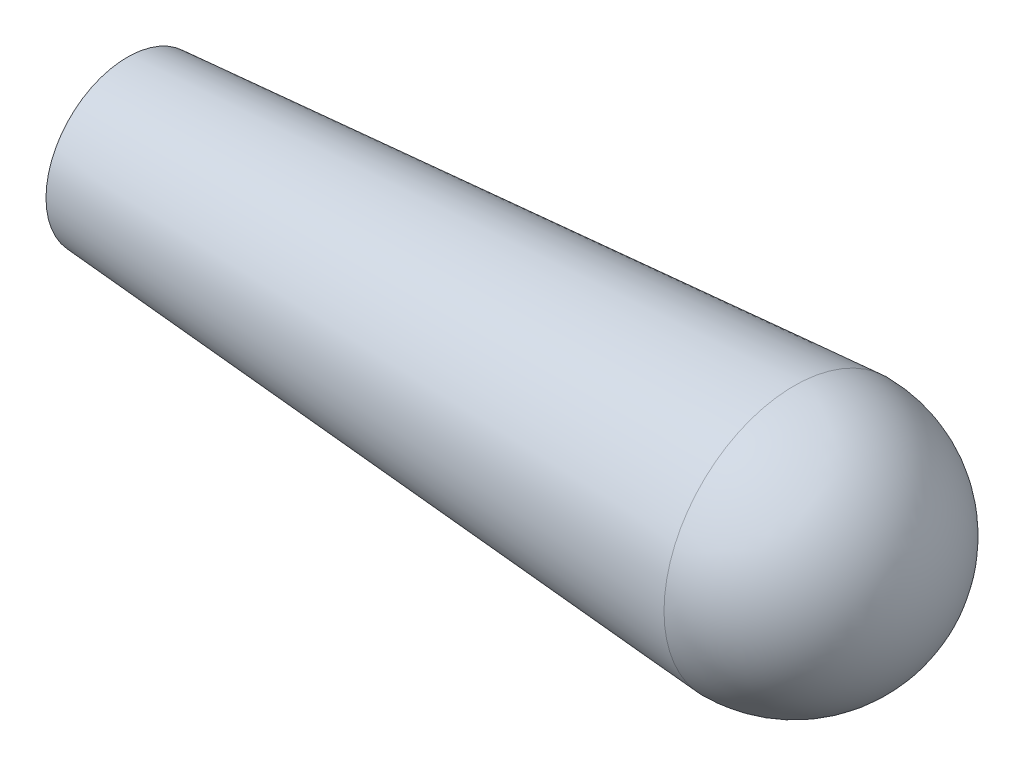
ISO-10303-21;
HEADER;
FILE_DESCRIPTION(('STEP AP214'),'2;1');
FILE_NAME('part.step','',(''),(''),'','','');
FILE_SCHEMA(('AUTOMOTIVE_DESIGN { 1 0 10303 214 1 1 1 1 }'));
ENDSEC;
DATA;
#1=APPLICATION_CONTEXT('core data for automotive mechanical design processes');
#2=APPLICATION_PROTOCOL_DEFINITION('international standard','automotive_design',2000,#1);
#3=PRODUCT_CONTEXT('',#1,'mechanical');
#4=PRODUCT('Part','Part','',(#3));
#5=PRODUCT_RELATED_PRODUCT_CATEGORY('part','',(#4));
#6=PRODUCT_DEFINITION_FORMATION('','',#4);
#7=PRODUCT_DEFINITION_CONTEXT('part definition',#1,'design');
#8=PRODUCT_DEFINITION('design','',#6,#7);
#9=PRODUCT_DEFINITION_SHAPE('','',#8);
#10=(LENGTH_UNIT() NAMED_UNIT(*) SI_UNIT(.MILLI.,.METRE.));
#11=(NAMED_UNIT(*) PLANE_ANGLE_UNIT() SI_UNIT($,.RADIAN.));
#12=(NAMED_UNIT(*) SI_UNIT($,.STERADIAN.) SOLID_ANGLE_UNIT());
#13=UNCERTAINTY_MEASURE_WITH_UNIT(LENGTH_MEASURE(1.E-05),#10,'distance_accuracy_value','');
#14=(GEOMETRIC_REPRESENTATION_CONTEXT(3) GLOBAL_UNCERTAINTY_ASSIGNED_CONTEXT((#13)) GLOBAL_UNIT_ASSIGNED_CONTEXT((#10,
#11,#12)) REPRESENTATION_CONTEXT('',''));
#15=CARTESIAN_POINT('',(0.,0.,0.));
#16=DIRECTION('',(0.,0.,1.));
#17=DIRECTION('',(1.,0.,0.));
#18=AXIS2_PLACEMENT_3D('',#15,#16,#17);
#19=CARTESIAN_POINT('',(-26.1260086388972,0.,0.));
#20=DIRECTION('',(1.,0.,0.));
#21=DIRECTION('',(0.,0.,-1.));
#22=AXIS2_PLACEMENT_3D('',#19,#20,#21);
#23=PLANE('',#22);
#24=DIRECTION('',(0.,0.,-1.));
#25=VECTOR('',#24,1.);
#26=CARTESIAN_POINT('',(-26.1260086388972,3.,-8.));
#27=LINE('',#26,#25);
#28=CARTESIAN_POINT('',(-26.1260086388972,3.,8.));
#29=VERTEX_POINT('',#28);
#30=CARTESIAN_POINT('',(-26.1260086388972,3.,-8.));
#31=VERTEX_POINT('',#30);
#32=EDGE_CURVE('E82',#29,#31,#27,.T.);
#33=ORIENTED_EDGE('',*,*,#32,.F.);
#34=DIRECTION('',(0.,1.,0.));
#35=VECTOR('',#34,1.);
#36=CARTESIAN_POINT('',(-26.1260086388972,-3.,8.));
#37=LINE('',#36,#35);
#38=CARTESIAN_POINT('',(-26.1260086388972,-3.,8.));
#39=VERTEX_POINT('',#38);
#40=EDGE_CURVE('E47',#39,#29,#37,.T.);
#41=ORIENTED_EDGE('',*,*,#40,.F.);
#42=DIRECTION('',(0.,0.,1.));
#43=VECTOR('',#42,1.);
#44=CARTESIAN_POINT('',(-26.1260086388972,-3.,-8.));
#45=LINE('',#44,#43);
#46=CARTESIAN_POINT('',(-26.1260086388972,-3.,-8.));
#47=VERTEX_POINT('',#46);
#48=EDGE_CURVE('E98',#47,#39,#45,.T.);
#49=ORIENTED_EDGE('',*,*,#48,.F.);
#50=DIRECTION('',(0.,-1.,0.));
#51=VECTOR('',#50,1.);
#52=CARTESIAN_POINT('',(-26.1260086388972,-3.,-8.));
#53=LINE('',#52,#51);
#54=EDGE_CURVE('E104',#31,#47,#53,.T.);
#55=ORIENTED_EDGE('',*,*,#54,.F.);
#56=EDGE_LOOP('',(#33,#41,#49,#55));
#57=FACE_BOUND('',#56,.T.);
#58=CARTESIAN_POINT('',(-26.1260086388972,0.,0.));
#59=DIRECTION('',(-1.,0.,0.));
#60=DIRECTION('',(0.,0.,1.));
#61=AXIS2_PLACEMENT_3D('',#58,#59,#60);
#62=CIRCLE('',#61,10.);
#63=CARTESIAN_POINT('',(-26.1260086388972,0.,10.));
#64=VERTEX_POINT('',#63);
#65=EDGE_CURVE('E11',#64,#64,#62,.T.);
#66=ORIENTED_EDGE('',*,*,#65,.T.);
#67=EDGE_LOOP('',(#66));
#68=FACE_BOUND('',#67,.T.);
#69=ADVANCED_FACE('F33',(#57,#68),#23,.F.);
#70=CARTESIAN_POINT('',(55.8739913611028,0.,0.));
#71=DIRECTION('',(1.,0.,0.));
#72=DIRECTION('',(0.,0.,-1.));
#73=AXIS2_PLACEMENT_3D('',#70,#71,#72);
#74=CONICAL_SURFACE('',#73,16.,0.0730405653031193);
#75=ORIENTED_EDGE('',*,*,#65,.F.);
#76=EDGE_LOOP('',(#75));
#77=FACE_BOUND('',#76,.T.);
#78=CARTESIAN_POINT('',(55.8739913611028,0.,0.));
#79=DIRECTION('',(-1.,0.,0.));
#80=DIRECTION('',(0.,0.,1.));
#81=AXIS2_PLACEMENT_3D('',#78,#79,#80);
#82=CIRCLE('',#81,16.);
#83=CARTESIAN_POINT('',(55.8739913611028,0.,16.));
#84=VERTEX_POINT('',#83);
#85=EDGE_CURVE('E40',#84,#84,#82,.T.);
#86=ORIENTED_EDGE('',*,*,#85,.T.);
#87=EDGE_LOOP('',(#86));
#88=FACE_BOUND('',#87,.T.);
#89=ADVANCED_FACE('F112',(#77,#88),#74,.T.);
#90=CARTESIAN_POINT('',(55.8739913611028,0.,0.));
#91=DIRECTION('',(-1.,0.,0.));
#92=DIRECTION('',(0.,-1.,0.));
#93=AXIS2_PLACEMENT_3D('',#90,#91,#92);
#94=SPHERICAL_SURFACE('',#93,16.);
#95=ORIENTED_EDGE('',*,*,#85,.F.);
#96=EDGE_LOOP('',(#95));
#97=FACE_BOUND('',#96,.T.);
#98=ADVANCED_FACE('F114',(#97),#94,.T.);
#99=CARTESIAN_POINT('',(51.8739913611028,-3.,8.));
#100=DIRECTION('',(0.,0.,1.));
#101=DIRECTION('',(1.,0.,0.));
#102=AXIS2_PLACEMENT_3D('',#99,#100,#101);
#103=PLANE('',#102);
#104=ORIENTED_EDGE('',*,*,#40,.T.);
#105=DIRECTION('',(-1.,0.,0.));
#106=VECTOR('',#105,1.);
#107=CARTESIAN_POINT('',(51.8739913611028,3.,8.));
#108=LINE('',#107,#106);
#109=CARTESIAN_POINT('',(51.8739913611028,3.,8.));
#110=VERTEX_POINT('',#109);
#111=EDGE_CURVE('E70',#110,#29,#108,.T.);
#112=ORIENTED_EDGE('',*,*,#111,.F.);
#113=DIRECTION('',(0.,1.,0.));
#114=VECTOR('',#113,1.);
#115=CARTESIAN_POINT('',(51.8739913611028,-3.,8.));
#116=LINE('',#115,#114);
#117=CARTESIAN_POINT('',(51.8739913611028,-3.,8.));
#118=VERTEX_POINT('',#117);
#119=EDGE_CURVE('E96',#118,#110,#116,.T.);
#120=ORIENTED_EDGE('',*,*,#119,.F.);
#121=DIRECTION('',(-1.,0.,0.));
#122=VECTOR('',#121,1.);
#123=CARTESIAN_POINT('',(51.8739913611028,-3.,8.));
#124=LINE('',#123,#122);
#125=EDGE_CURVE('E55',#118,#39,#124,.T.);
#126=ORIENTED_EDGE('',*,*,#125,.T.);
#127=EDGE_LOOP('',(#104,#112,#120,#126));
#128=FACE_BOUND('',#127,.T.);
#129=ADVANCED_FACE('F116',(#128),#103,.F.);
#130=CARTESIAN_POINT('',(51.8739913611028,-3.,-8.));
#131=DIRECTION('',(0.,-1.,0.));
#132=DIRECTION('',(0.,0.,-1.));
#133=AXIS2_PLACEMENT_3D('',#130,#131,#132);
#134=PLANE('',#133);
#135=ORIENTED_EDGE('',*,*,#48,.T.);
#136=ORIENTED_EDGE('',*,*,#125,.F.);
#137=DIRECTION('',(0.,0.,1.));
#138=VECTOR('',#137,1.);
#139=CARTESIAN_POINT('',(51.8739913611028,-3.,-8.));
#140=LINE('',#139,#138);
#141=CARTESIAN_POINT('',(51.8739913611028,-3.,-8.));
#142=VERTEX_POINT('',#141);
#143=EDGE_CURVE('E93',#142,#118,#140,.T.);
#144=ORIENTED_EDGE('',*,*,#143,.F.);
#145=DIRECTION('',(-1.,0.,0.));
#146=VECTOR('',#145,1.);
#147=CARTESIAN_POINT('',(51.8739913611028,-3.,-8.));
#148=LINE('',#147,#146);
#149=EDGE_CURVE('E86',#142,#47,#148,.T.);
#150=ORIENTED_EDGE('',*,*,#149,.T.);
#151=EDGE_LOOP('',(#135,#136,#144,#150));
#152=FACE_BOUND('',#151,.T.);
#153=ADVANCED_FACE('F122',(#152),#134,.F.);
#154=CARTESIAN_POINT('',(51.8739913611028,-3.,-8.));
#155=DIRECTION('',(0.,0.,-1.));
#156=DIRECTION('',(-1.,0.,0.));
#157=AXIS2_PLACEMENT_3D('',#154,#155,#156);
#158=PLANE('',#157);
#159=ORIENTED_EDGE('',*,*,#54,.T.);
#160=ORIENTED_EDGE('',*,*,#149,.F.);
#161=DIRECTION('',(0.,-1.,0.));
#162=VECTOR('',#161,1.);
#163=CARTESIAN_POINT('',(51.8739913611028,-3.,-8.));
#164=LINE('',#163,#162);
#165=CARTESIAN_POINT('',(51.8739913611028,3.,-8.));
#166=VERTEX_POINT('',#165);
#167=EDGE_CURVE('E89',#166,#142,#164,.T.);
#168=ORIENTED_EDGE('',*,*,#167,.F.);
#169=DIRECTION('',(-1.,0.,0.));
#170=VECTOR('',#169,1.);
#171=CARTESIAN_POINT('',(51.8739913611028,3.,-8.));
#172=LINE('',#171,#170);
#173=EDGE_CURVE('E75',#166,#31,#172,.T.);
#174=ORIENTED_EDGE('',*,*,#173,.T.);
#175=EDGE_LOOP('',(#159,#160,#168,#174));
#176=FACE_BOUND('',#175,.T.);
#177=ADVANCED_FACE('F90',(#176),#158,.F.);
#178=CARTESIAN_POINT('',(51.8739913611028,3.,-8.));
#179=DIRECTION('',(0.,1.,0.));
#180=DIRECTION('',(0.,0.,1.));
#181=AXIS2_PLACEMENT_3D('',#178,#179,#180);
#182=PLANE('',#181);
#183=ORIENTED_EDGE('',*,*,#32,.T.);
#184=ORIENTED_EDGE('',*,*,#173,.F.);
#185=DIRECTION('',(0.,0.,-1.));
#186=VECTOR('',#185,1.);
#187=CARTESIAN_POINT('',(51.8739913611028,3.,-8.));
#188=LINE('',#187,#186);
#189=EDGE_CURVE('E79',#110,#166,#188,.T.);
#190=ORIENTED_EDGE('',*,*,#189,.F.);
#191=ORIENTED_EDGE('',*,*,#111,.T.);
#192=EDGE_LOOP('',(#183,#184,#190,#191));
#193=FACE_BOUND('',#192,.T.);
#194=ADVANCED_FACE('F77',(#193),#182,.F.);
#195=CARTESIAN_POINT('',(51.8739913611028,0.,0.));
#196=DIRECTION('',(1.,0.,0.));
#197=DIRECTION('',(0.,0.,-1.));
#198=AXIS2_PLACEMENT_3D('',#195,#196,#197);
#199=PLANE('',#198);
#200=ORIENTED_EDGE('',*,*,#119,.T.);
#201=ORIENTED_EDGE('',*,*,#189,.T.);
#202=ORIENTED_EDGE('',*,*,#167,.T.);
#203=ORIENTED_EDGE('',*,*,#143,.T.);
#204=EDGE_LOOP('',(#200,#201,#202,#203));
#205=FACE_BOUND('',#204,.T.);
#206=ADVANCED_FACE('F95',(#205),#199,.F.);
#207=CLOSED_SHELL('',(#69,#89,#98,#129,#153,#177,#194,#206));
#208=MANIFOLD_SOLID_BREP('B2',#207);
#209=ADVANCED_BREP_SHAPE_REPRESENTATION('',(#18,#208),#14);
#210=SHAPE_DEFINITION_REPRESENTATION(#9,#209);
ENDSEC;
END-ISO-10303-21;
